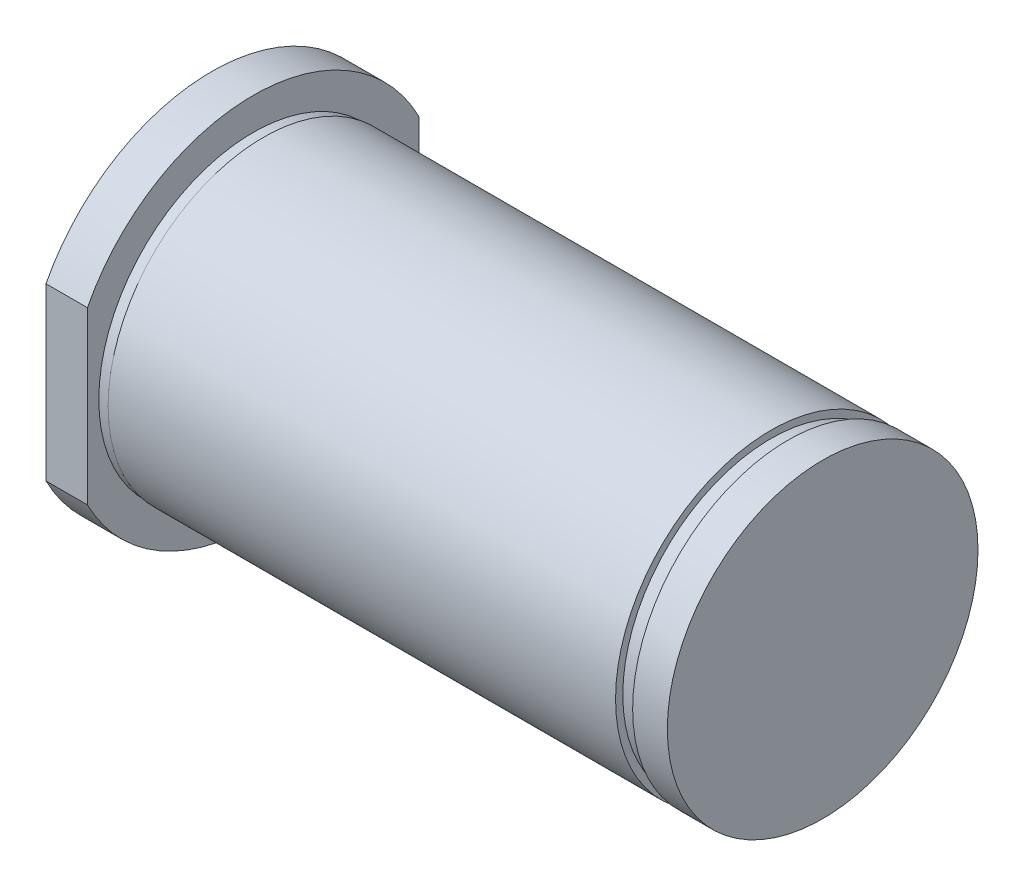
ISO-10303-21;
HEADER;
FILE_DESCRIPTION(('STEP AP214'),'2;1');
FILE_NAME('part.step','',(''),(''),'','','');
FILE_SCHEMA(('AUTOMOTIVE_DESIGN { 1 0 10303 214 1 1 1 1 }'));
ENDSEC;
DATA;
#1=APPLICATION_CONTEXT('core data for automotive mechanical design processes');
#2=APPLICATION_PROTOCOL_DEFINITION('international standard','automotive_design',2000,#1);
#3=PRODUCT_CONTEXT('',#1,'mechanical');
#4=PRODUCT('Part','Part','',(#3));
#5=PRODUCT_RELATED_PRODUCT_CATEGORY('part','',(#4));
#6=PRODUCT_DEFINITION_FORMATION('','',#4);
#7=PRODUCT_DEFINITION_CONTEXT('part definition',#1,'design');
#8=PRODUCT_DEFINITION('design','',#6,#7);
#9=PRODUCT_DEFINITION_SHAPE('','',#8);
#10=(LENGTH_UNIT() NAMED_UNIT(*) SI_UNIT(.MILLI.,.METRE.));
#11=(NAMED_UNIT(*) PLANE_ANGLE_UNIT() SI_UNIT($,.RADIAN.));
#12=(NAMED_UNIT(*) SI_UNIT($,.STERADIAN.) SOLID_ANGLE_UNIT());
#13=UNCERTAINTY_MEASURE_WITH_UNIT(LENGTH_MEASURE(1.E-05),#10,'distance_accuracy_value','');
#14=(GEOMETRIC_REPRESENTATION_CONTEXT(3) GLOBAL_UNCERTAINTY_ASSIGNED_CONTEXT((#13)) GLOBAL_UNIT_ASSIGNED_CONTEXT((#10,
#11,#12)) REPRESENTATION_CONTEXT('',''));
#15=CARTESIAN_POINT('',(0.,0.,0.));
#16=DIRECTION('',(0.,0.,1.));
#17=DIRECTION('',(1.,0.,0.));
#18=AXIS2_PLACEMENT_3D('',#15,#16,#17);
#19=CARTESIAN_POINT('',(59.,0.,0.));
#20=DIRECTION('',(-1.,0.,0.));
#21=DIRECTION('',(0.,0.,1.));
#22=AXIS2_PLACEMENT_3D('',#19,#20,#21);
#23=CYLINDRICAL_SURFACE('',#22,18.);
#24=CARTESIAN_POINT('',(4.,0.,0.));
#25=DIRECTION('',(-1.,0.,0.));
#26=DIRECTION('',(0.,0.,1.));
#27=AXIS2_PLACEMENT_3D('',#24,#25,#26);
#28=CIRCLE('',#27,18.);
#29=CARTESIAN_POINT('',(4.,-8.24621125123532,-16.));
#30=VERTEX_POINT('',#29);
#31=CARTESIAN_POINT('',(4.,-8.24621125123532,16.));
#32=VERTEX_POINT('',#31);
#33=EDGE_CURVE('E103',#30,#32,#28,.T.);
#34=ORIENTED_EDGE('',*,*,#33,.T.);
#35=DIRECTION('',(-1.,0.,0.));
#36=VECTOR('',#35,1.);
#37=CARTESIAN_POINT('',(59.,-8.24621125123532,16.));
#38=LINE('',#37,#36);
#39=CARTESIAN_POINT('',(0.,-8.24621125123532,16.));
#40=VERTEX_POINT('',#39);
#41=EDGE_CURVE('E55',#32,#40,#38,.T.);
#42=ORIENTED_EDGE('',*,*,#41,.T.);
#43=CARTESIAN_POINT('',(0.,0.,0.));
#44=DIRECTION('',(-1.,0.,0.));
#45=DIRECTION('',(0.,0.,1.));
#46=AXIS2_PLACEMENT_3D('',#43,#44,#45);
#47=CIRCLE('',#46,18.);
#48=CARTESIAN_POINT('',(0.,-8.24621125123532,-16.));
#49=VERTEX_POINT('',#48);
#50=EDGE_CURVE('E95',#49,#40,#47,.T.);
#51=ORIENTED_EDGE('',*,*,#50,.F.);
#52=DIRECTION('',(-1.,0.,0.));
#53=VECTOR('',#52,1.);
#54=CARTESIAN_POINT('',(59.,-8.24621125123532,-16.));
#55=LINE('',#54,#53);
#56=EDGE_CURVE('E81',#49,#30,#55,.F.);
#57=ORIENTED_EDGE('',*,*,#56,.T.);
#58=EDGE_LOOP('',(#34,#42,#51,#57));
#59=FACE_BOUND('',#58,.T.);
#60=ADVANCED_FACE('F40',(#59),#23,.T.);
#61=CARTESIAN_POINT('',(0.,0.,0.));
#62=DIRECTION('',(1.,0.,0.));
#63=DIRECTION('',(0.,0.,-1.));
#64=AXIS2_PLACEMENT_3D('',#61,#62,#63);
#65=PLANE('',#64);
#66=ORIENTED_EDGE('',*,*,#50,.T.);
#67=DIRECTION('',(0.,-1.,0.));
#68=VECTOR('',#67,1.);
#69=CARTESIAN_POINT('',(0.,36.,16.));
#70=LINE('',#69,#68);
#71=CARTESIAN_POINT('',(0.,8.24621125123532,16.));
#72=VERTEX_POINT('',#71);
#73=EDGE_CURVE('E98',#72,#40,#70,.T.);
#74=ORIENTED_EDGE('',*,*,#73,.F.);
#75=CARTESIAN_POINT('',(0.,8.24621125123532,-16.));
#76=VERTEX_POINT('',#75);
#77=EDGE_CURVE('E97',#72,#76,#47,.T.);
#78=ORIENTED_EDGE('',*,*,#77,.T.);
#79=DIRECTION('',(0.,1.,0.));
#80=VECTOR('',#79,1.);
#81=CARTESIAN_POINT('',(0.,-36.,-16.));
#82=LINE('',#81,#80);
#83=EDGE_CURVE('E84',#49,#76,#82,.T.);
#84=ORIENTED_EDGE('',*,*,#83,.F.);
#85=EDGE_LOOP('',(#66,#74,#78,#84));
#86=FACE_BOUND('',#85,.T.);
#87=CARTESIAN_POINT('',(0.,0.,0.));
#88=DIRECTION('',(-1.,0.,0.));
#89=DIRECTION('',(0.,0.,1.));
#90=AXIS2_PLACEMENT_3D('',#87,#88,#89);
#91=CIRCLE('',#90,8.);
#92=CARTESIAN_POINT('',(0.,0.,8.));
#93=VERTEX_POINT('',#92);
#94=EDGE_CURVE('E124',#93,#93,#91,.T.);
#95=ORIENTED_EDGE('',*,*,#94,.F.);
#96=EDGE_LOOP('',(#95));
#97=FACE_BOUND('',#96,.T.);
#98=ADVANCED_FACE('F42',(#86,#97),#65,.F.);
#99=ORIENTED_EDGE('',*,*,#77,.F.);
#100=DIRECTION('',(-1.,0.,0.));
#101=VECTOR('',#100,1.);
#102=CARTESIAN_POINT('',(59.,8.24621125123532,16.));
#103=LINE('',#102,#101);
#104=CARTESIAN_POINT('',(4.,8.24621125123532,16.));
#105=VERTEX_POINT('',#104);
#106=EDGE_CURVE('E113',#72,#105,#103,.F.);
#107=ORIENTED_EDGE('',*,*,#106,.T.);
#108=CARTESIAN_POINT('',(4.,8.24621125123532,-16.));
#109=VERTEX_POINT('',#108);
#110=EDGE_CURVE('E100',#105,#109,#28,.T.);
#111=ORIENTED_EDGE('',*,*,#110,.T.);
#112=DIRECTION('',(-1.,0.,0.));
#113=VECTOR('',#112,1.);
#114=CARTESIAN_POINT('',(59.,8.24621125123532,-16.));
#115=LINE('',#114,#113);
#116=EDGE_CURVE('E62',#109,#76,#115,.T.);
#117=ORIENTED_EDGE('',*,*,#116,.T.);
#118=EDGE_LOOP('',(#99,#107,#111,#117));
#119=FACE_BOUND('',#118,.T.);
#120=ADVANCED_FACE('F112',(#119),#23,.T.);
#121=CARTESIAN_POINT('',(4.,18.,0.));
#122=DIRECTION('',(-1.,0.,0.));
#123=DIRECTION('',(0.,0.,1.));
#124=AXIS2_PLACEMENT_3D('',#121,#122,#123);
#125=PLANE('',#124);
#126=ORIENTED_EDGE('',*,*,#110,.F.);
#127=DIRECTION('',(0.,-1.,0.));
#128=VECTOR('',#127,1.);
#129=CARTESIAN_POINT('',(4.,18.,16.));
#130=LINE('',#129,#128);
#131=EDGE_CURVE('E11',#105,#32,#130,.T.);
#132=ORIENTED_EDGE('',*,*,#131,.T.);
#133=ORIENTED_EDGE('',*,*,#33,.F.);
#134=DIRECTION('',(0.,1.,0.));
#135=VECTOR('',#134,1.);
#136=CARTESIAN_POINT('',(4.,18.,-16.));
#137=LINE('',#136,#135);
#138=EDGE_CURVE('E48',#30,#109,#137,.T.);
#139=ORIENTED_EDGE('',*,*,#138,.T.);
#140=EDGE_LOOP('',(#126,#132,#133,#139));
#141=FACE_BOUND('',#140,.T.);
#142=CARTESIAN_POINT('',(4.,0.,0.));
#143=DIRECTION('',(-1.,0.,0.));
#144=DIRECTION('',(0.,0.,1.));
#145=AXIS2_PLACEMENT_3D('',#142,#143,#144);
#146=CIRCLE('',#145,14.9);
#147=CARTESIAN_POINT('',(4.,0.,14.9));
#148=VERTEX_POINT('',#147);
#149=EDGE_CURVE('E152',#148,#148,#146,.T.);
#150=ORIENTED_EDGE('',*,*,#149,.T.);
#151=EDGE_LOOP('',(#150));
#152=FACE_BOUND('',#151,.T.);
#153=ADVANCED_FACE('F108',(#141,#152),#125,.F.);
#154=CARTESIAN_POINT('',(59.,0.,0.));
#155=DIRECTION('',(-1.,0.,0.));
#156=DIRECTION('',(0.,0.,1.));
#157=AXIS2_PLACEMENT_3D('',#154,#155,#156);
#158=CYLINDRICAL_SURFACE('',#157,14.9);
#159=ORIENTED_EDGE('',*,*,#149,.F.);
#160=EDGE_LOOP('',(#159));
#161=FACE_BOUND('',#160,.T.);
#162=CARTESIAN_POINT('',(5.,0.,0.));
#163=DIRECTION('',(-1.,0.,0.));
#164=DIRECTION('',(0.,0.,1.));
#165=AXIS2_PLACEMENT_3D('',#162,#163,#164);
#166=CIRCLE('',#165,14.9);
#167=CARTESIAN_POINT('',(5.,0.,14.9));
#168=VERTEX_POINT('',#167);
#169=EDGE_CURVE('E150',#168,#168,#166,.T.);
#170=ORIENTED_EDGE('',*,*,#169,.T.);
#171=EDGE_LOOP('',(#170));
#172=FACE_BOUND('',#171,.T.);
#173=ADVANCED_FACE('F156',(#161,#172),#158,.T.);
#174=CARTESIAN_POINT('',(5.,14.9,0.));
#175=DIRECTION('',(1.,0.,0.));
#176=DIRECTION('',(0.,0.,-1.));
#177=AXIS2_PLACEMENT_3D('',#174,#175,#176);
#178=PLANE('',#177);
#179=ORIENTED_EDGE('',*,*,#169,.F.);
#180=EDGE_LOOP('',(#179));
#181=FACE_BOUND('',#180,.T.);
#182=CARTESIAN_POINT('',(5.,0.,0.));
#183=DIRECTION('',(-1.,0.,0.));
#184=DIRECTION('',(0.,0.,1.));
#185=AXIS2_PLACEMENT_3D('',#182,#183,#184);
#186=CIRCLE('',#185,15.);
#187=CARTESIAN_POINT('',(5.,0.,15.));
#188=VERTEX_POINT('',#187);
#189=EDGE_CURVE('E147',#188,#188,#186,.T.);
#190=ORIENTED_EDGE('',*,*,#189,.T.);
#191=EDGE_LOOP('',(#190));
#192=FACE_BOUND('',#191,.T.);
#193=ADVANCED_FACE('F159',(#181,#192),#178,.F.);
#194=CARTESIAN_POINT('',(59.,0.,0.));
#195=DIRECTION('',(-1.,0.,0.));
#196=DIRECTION('',(0.,0.,1.));
#197=AXIS2_PLACEMENT_3D('',#194,#195,#196);
#198=CYLINDRICAL_SURFACE('',#197,15.);
#199=ORIENTED_EDGE('',*,*,#189,.F.);
#200=EDGE_LOOP('',(#199));
#201=FACE_BOUND('',#200,.T.);
#202=CARTESIAN_POINT('',(54.,0.,0.));
#203=DIRECTION('',(-1.,0.,0.));
#204=DIRECTION('',(0.,0.,1.));
#205=AXIS2_PLACEMENT_3D('',#202,#203,#204);
#206=CIRCLE('',#205,15.);
#207=CARTESIAN_POINT('',(54.,0.,15.));
#208=VERTEX_POINT('',#207);
#209=EDGE_CURVE('E143',#208,#208,#206,.T.);
#210=ORIENTED_EDGE('',*,*,#209,.T.);
#211=EDGE_LOOP('',(#210));
#212=FACE_BOUND('',#211,.T.);
#213=ADVANCED_FACE('F165',(#201,#212),#198,.T.);
#214=CARTESIAN_POINT('',(54.,15.,0.));
#215=DIRECTION('',(-1.,0.,0.));
#216=DIRECTION('',(0.,0.,1.));
#217=AXIS2_PLACEMENT_3D('',#214,#215,#216);
#218=PLANE('',#217);
#219=ORIENTED_EDGE('',*,*,#209,.F.);
#220=EDGE_LOOP('',(#219));
#221=FACE_BOUND('',#220,.T.);
#222=CARTESIAN_POINT('',(54.,0.,0.));
#223=DIRECTION('',(-1.,0.,0.));
#224=DIRECTION('',(0.,0.,1.));
#225=AXIS2_PLACEMENT_3D('',#222,#223,#224);
#226=CIRCLE('',#225,14.3);
#227=CARTESIAN_POINT('',(54.,0.,14.3));
#228=VERTEX_POINT('',#227);
#229=EDGE_CURVE('E139',#228,#228,#226,.T.);
#230=ORIENTED_EDGE('',*,*,#229,.T.);
#231=EDGE_LOOP('',(#230));
#232=FACE_BOUND('',#231,.T.);
#233=ADVANCED_FACE('F171',(#221,#232),#218,.F.);
#234=CARTESIAN_POINT('',(59.,0.,0.));
#235=DIRECTION('',(-1.,0.,0.));
#236=DIRECTION('',(0.,0.,1.));
#237=AXIS2_PLACEMENT_3D('',#234,#235,#236);
#238=CYLINDRICAL_SURFACE('',#237,14.3);
#239=ORIENTED_EDGE('',*,*,#229,.F.);
#240=EDGE_LOOP('',(#239));
#241=FACE_BOUND('',#240,.T.);
#242=CARTESIAN_POINT('',(55.65,0.,0.));
#243=DIRECTION('',(-1.,0.,0.));
#244=DIRECTION('',(0.,0.,1.));
#245=AXIS2_PLACEMENT_3D('',#242,#243,#244);
#246=CIRCLE('',#245,14.3);
#247=CARTESIAN_POINT('',(55.65,0.,14.3));
#248=VERTEX_POINT('',#247);
#249=EDGE_CURVE('E135',#248,#248,#246,.T.);
#250=ORIENTED_EDGE('',*,*,#249,.T.);
#251=EDGE_LOOP('',(#250));
#252=FACE_BOUND('',#251,.T.);
#253=ADVANCED_FACE('F177',(#241,#252),#238,.T.);
#254=CARTESIAN_POINT('',(55.65,14.3,0.));
#255=DIRECTION('',(1.,0.,0.));
#256=DIRECTION('',(0.,0.,-1.));
#257=AXIS2_PLACEMENT_3D('',#254,#255,#256);
#258=PLANE('',#257);
#259=ORIENTED_EDGE('',*,*,#249,.F.);
#260=EDGE_LOOP('',(#259));
#261=FACE_BOUND('',#260,.T.);
#262=CARTESIAN_POINT('',(55.65,0.,0.));
#263=DIRECTION('',(-1.,0.,0.));
#264=DIRECTION('',(0.,0.,1.));
#265=AXIS2_PLACEMENT_3D('',#262,#263,#264);
#266=CIRCLE('',#265,15.);
#267=CARTESIAN_POINT('',(55.65,0.,15.));
#268=VERTEX_POINT('',#267);
#269=EDGE_CURVE('E131',#268,#268,#266,.T.);
#270=ORIENTED_EDGE('',*,*,#269,.T.);
#271=EDGE_LOOP('',(#270));
#272=FACE_BOUND('',#271,.T.);
#273=ADVANCED_FACE('F183',(#261,#272),#258,.F.);
#274=CARTESIAN_POINT('',(59.,0.,0.));
#275=DIRECTION('',(-1.,0.,0.));
#276=DIRECTION('',(0.,0.,1.));
#277=AXIS2_PLACEMENT_3D('',#274,#275,#276);
#278=CYLINDRICAL_SURFACE('',#277,15.);
#279=ORIENTED_EDGE('',*,*,#269,.F.);
#280=EDGE_LOOP('',(#279));
#281=FACE_BOUND('',#280,.T.);
#282=CARTESIAN_POINT('',(59.,0.,0.));
#283=DIRECTION('',(-1.,0.,0.));
#284=DIRECTION('',(0.,0.,1.));
#285=AXIS2_PLACEMENT_3D('',#282,#283,#284);
#286=CIRCLE('',#285,15.);
#287=CARTESIAN_POINT('',(59.,0.,15.));
#288=VERTEX_POINT('',#287);
#289=EDGE_CURVE('E127',#288,#288,#286,.T.);
#290=ORIENTED_EDGE('',*,*,#289,.T.);
#291=EDGE_LOOP('',(#290));
#292=FACE_BOUND('',#291,.T.);
#293=ADVANCED_FACE('F189',(#281,#292),#278,.T.);
#294=CARTESIAN_POINT('',(59.,15.,0.));
#295=DIRECTION('',(-1.,0.,0.));
#296=DIRECTION('',(0.,0.,1.));
#297=AXIS2_PLACEMENT_3D('',#294,#295,#296);
#298=PLANE('',#297);
#299=ORIENTED_EDGE('',*,*,#289,.F.);
#300=EDGE_LOOP('',(#299));
#301=FACE_BOUND('',#300,.T.);
#302=ADVANCED_FACE('F195',(#301),#298,.F.);
#303=CARTESIAN_POINT('',(1.0825,0.,0.));
#304=DIRECTION('',(-1.,0.,0.));
#305=DIRECTION('',(0.,0.,1.));
#306=AXIS2_PLACEMENT_3D('',#303,#304,#305);
#307=CONICAL_SURFACE('',#306,6.9175,0.785398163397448);
#308=ORIENTED_EDGE('',*,*,#94,.T.);
#309=EDGE_LOOP('',(#308));
#310=FACE_BOUND('',#309,.T.);
#311=CARTESIAN_POINT('',(1.0825,0.,0.));
#312=DIRECTION('',(-1.,0.,0.));
#313=DIRECTION('',(0.,0.,1.));
#314=AXIS2_PLACEMENT_3D('',#311,#312,#313);
#315=CIRCLE('',#314,6.9175);
#316=CARTESIAN_POINT('',(1.0825,0.,6.9175));
#317=VERTEX_POINT('',#316);
#318=EDGE_CURVE('E121',#317,#317,#315,.T.);
#319=ORIENTED_EDGE('',*,*,#318,.F.);
#320=EDGE_LOOP('',(#319));
#321=FACE_BOUND('',#320,.T.);
#322=ADVANCED_FACE('F200',(#310,#321),#307,.F.);
#323=CARTESIAN_POINT('',(34.993820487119,0.,0.));
#324=DIRECTION('',(-1.,0.,0.));
#325=DIRECTION('',(0.,0.,1.));
#326=AXIS2_PLACEMENT_3D('',#323,#324,#325);
#327=CYLINDRICAL_SURFACE('',#326,6.9175);
#328=ORIENTED_EDGE('',*,*,#318,.T.);
#329=EDGE_LOOP('',(#328));
#330=FACE_BOUND('',#329,.T.);
#331=CARTESIAN_POINT('',(31.,0.,0.));
#332=DIRECTION('',(-1.,0.,0.));
#333=DIRECTION('',(0.,0.,1.));
#334=AXIS2_PLACEMENT_3D('',#331,#332,#333);
#335=CIRCLE('',#334,6.9175);
#336=CARTESIAN_POINT('',(31.,0.,6.9175));
#337=VERTEX_POINT('',#336);
#338=EDGE_CURVE('E115',#337,#337,#335,.T.);
#339=ORIENTED_EDGE('',*,*,#338,.F.);
#340=EDGE_LOOP('',(#339));
#341=FACE_BOUND('',#340,.T.);
#342=ADVANCED_FACE('F205',(#330,#341),#327,.F.);
#343=CARTESIAN_POINT('',(34.993820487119,0.,0.));
#344=DIRECTION('',(-1.,0.,0.));
#345=DIRECTION('',(0.,0.,1.));
#346=AXIS2_PLACEMENT_3D('',#343,#344,#345);
#347=CONICAL_SURFACE('',#346,0.,1.04719755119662);
#348=ORIENTED_EDGE('',*,*,#338,.T.);
#349=EDGE_LOOP('',(#348));
#350=FACE_BOUND('',#349,.T.);
#351=CARTESIAN_POINT('',(34.993820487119,0.,0.));
#352=VERTEX_POINT('',#351);
#353=VERTEX_LOOP('',#352);
#354=FACE_BOUND('',#353,.T.);
#355=ADVANCED_FACE('F266',(#350,#354),#347,.F.);
#356=CARTESIAN_POINT('',(4.,-36.,-16.));
#357=DIRECTION('',(0.,0.,1.));
#358=DIRECTION('',(1.,0.,0.));
#359=AXIS2_PLACEMENT_3D('',#356,#357,#358);
#360=PLANE('',#359);
#361=ORIENTED_EDGE('',*,*,#138,.F.);
#362=ORIENTED_EDGE('',*,*,#56,.F.);
#363=ORIENTED_EDGE('',*,*,#83,.T.);
#364=ORIENTED_EDGE('',*,*,#116,.F.);
#365=EDGE_LOOP('',(#361,#362,#363,#364));
#366=FACE_BOUND('',#365,.T.);
#367=ADVANCED_FACE('F83',(#366),#360,.F.);
#368=CARTESIAN_POINT('',(4.,36.,16.));
#369=DIRECTION('',(0.,0.,-1.));
#370=DIRECTION('',(-1.,0.,0.));
#371=AXIS2_PLACEMENT_3D('',#368,#369,#370);
#372=PLANE('',#371);
#373=ORIENTED_EDGE('',*,*,#131,.F.);
#374=ORIENTED_EDGE('',*,*,#106,.F.);
#375=ORIENTED_EDGE('',*,*,#73,.T.);
#376=ORIENTED_EDGE('',*,*,#41,.F.);
#377=EDGE_LOOP('',(#373,#374,#375,#376));
#378=FACE_BOUND('',#377,.T.);
#379=ADVANCED_FACE('F318',(#378),#372,.F.);
#380=CLOSED_SHELL('',(#60,#98,#120,#153,#173,#193,#213,#233,#253,#273,#293,#302,#322,#342,#355,
#367,#379));
#381=MANIFOLD_SOLID_BREP('B2',#380);
#382=ADVANCED_BREP_SHAPE_REPRESENTATION('',(#18,#381),#14);
#383=SHAPE_DEFINITION_REPRESENTATION(#9,#382);
ENDSEC;
END-ISO-10303-21;
